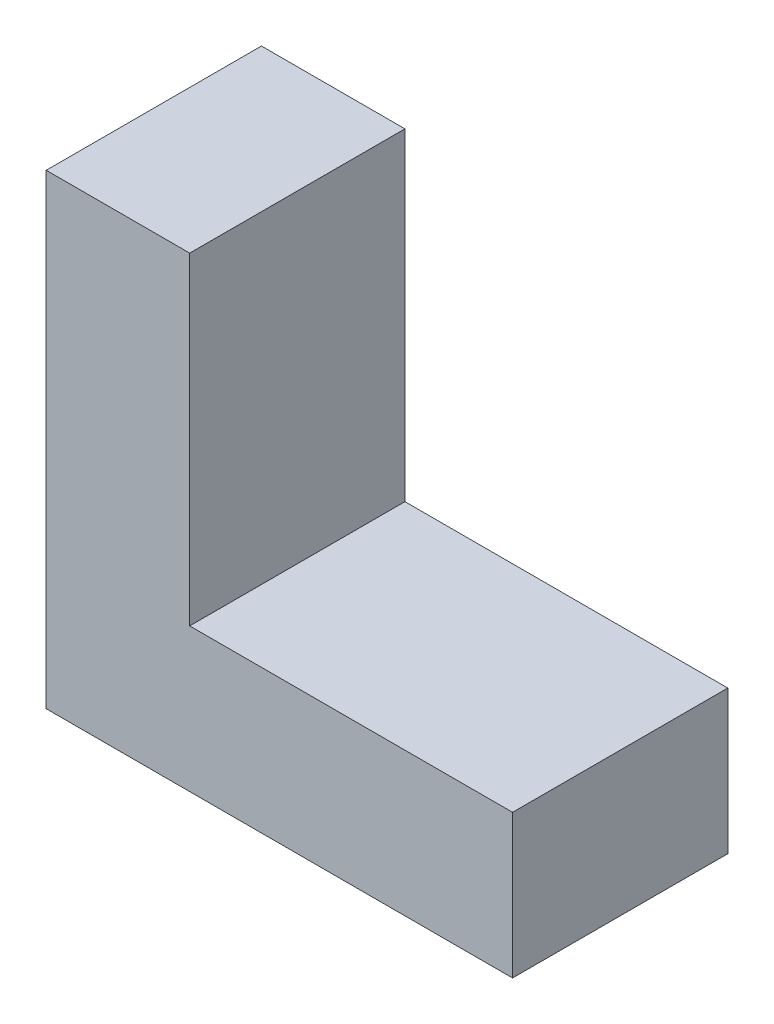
from build123d import *

# Parameters (mm, degrees)
EXTRUSION1_DEPTH = 6


with BuildPart() as part:
    # Esquisse1 → Extrusion1 (new body)
    with BuildSketch(Plane.XY):
        Polygon((0, 0), (13, 0), (13, 4), (4, 4), (4, 13), (0, 13), align=None)
    extrude(amount=EXTRUSION1_DEPTH)


solid = part.part
